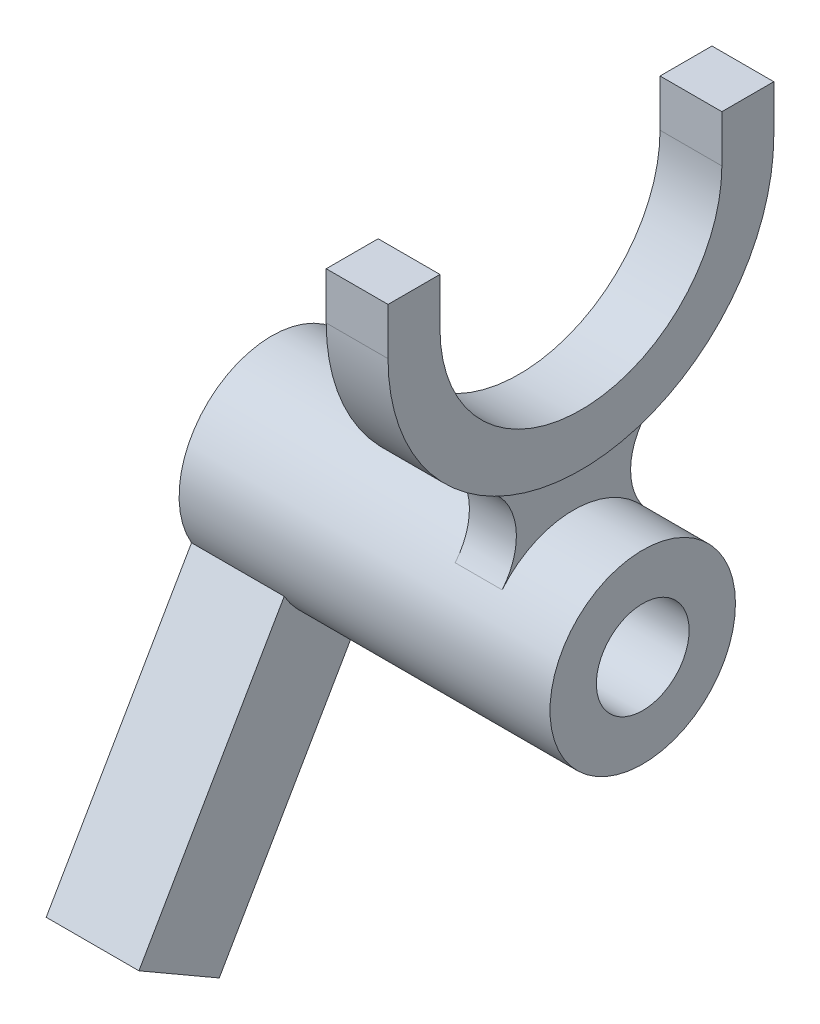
from build123d import *

# Parameters (mm, degrees)
EXTRUDE1_DEPTH      = 19.05
EXTRUDE1_DEPTH_BACK = 57.15
SKETCH1_R           = 19.05
SKETCH1_R_2         = 9.525
EXTRUDE_THIN1_DEPTH = 6.35
EXTRUDE2_DEPTH      = 4.826
EXTRUDE4_DEPTH      = 19.05


with BuildPart() as part:
    # Sketch1 → Extrude1 (new, two sides: drawn at the far end of the back side and taken through both)
    with BuildSketch(Plane(origin=(0, 0, 0), x_dir=(0, 0, -1), z_dir=(1, 0, 0)).offset(-EXTRUDE1_DEPTH_BACK)):
        Circle(SKETCH1_R)
        Circle(SKETCH1_R_2, mode=Mode.SUBTRACT)
    extrude(amount=EXTRUDE1_DEPTH + EXTRUDE1_DEPTH_BACK)



with BuildPart() as body_2:
    # Sketch2 → Extrude-Thin1 (new, symmetric)
    with BuildSketch(Plane(origin=(0, 0, 0), x_dir=(0, 0, -1), z_dir=(1, 0, 0))):
        with BuildLine():
            Line((-39.624, 76.2), (-39.624, 66.548))
            ThreePointArc((-39.624, 66.548), (0, 26.924), (39.624, 66.548))
            Line((39.624, 66.548), (39.624, 76.2))
            Line((39.624, 76.2), (28.956, 76.2))
            Line((28.956, 76.2), (28.956, 66.548))
            ThreePointArc((28.956, 66.548), (0, 37.592), (-28.956, 66.548))
            Line((-28.956, 66.548), (-28.956, 76.2))
            Line((-28.956, 76.2), (-39.624, 76.2))
        make_face()
    extrude(amount=EXTRUDE_THIN1_DEPTH, both=True)


with BuildPart() as part_1:
    add(part.part)

    add(body_2.part)  # Extrude2 merges body 2
    # Sketch3 → Extrude2 (add, symmetric)
    with BuildSketch(Plane(origin=(0, 0, 0), x_dir=(0, 0, -1), z_dir=(1, 0, 0))):
        with BuildLine():
            ThreePointArc((18.501121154, 31.508452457), (11.974406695, 22.752517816), (14.658580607, 12.166696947))
            ThreePointArc((14.658580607, 12.166696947), (0, 19.05), (-14.658580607, 12.166696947))
            ThreePointArc((-14.658580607, 12.166696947), (-11.974406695, 22.752517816), (-18.501121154, 31.508452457))
            ThreePointArc((-18.501121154, 31.508452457), (0, 26.924), (18.501121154, 31.508452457))
        make_face()
    extrude(amount=EXTRUDE2_DEPTH, both=True)

    # Sketch6 → Extrude4 (add)
    with BuildSketch(Plane.ZY.offset(57.15)):
        with BuildLine():
            Line((46.348891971, -61.228635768), (16.497783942, -9.525))
            ThreePointArc((16.497783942, -9.525), (9.525, -16.497783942), (0, -19.05))
            Line((0, -19.05), (29.851108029, -70.753635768))
            Line((29.851108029, -70.753635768), (46.348891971, -61.228635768))
        make_face()
    extrude(amount=-EXTRUDE4_DEPTH)


solid = part_1.part
